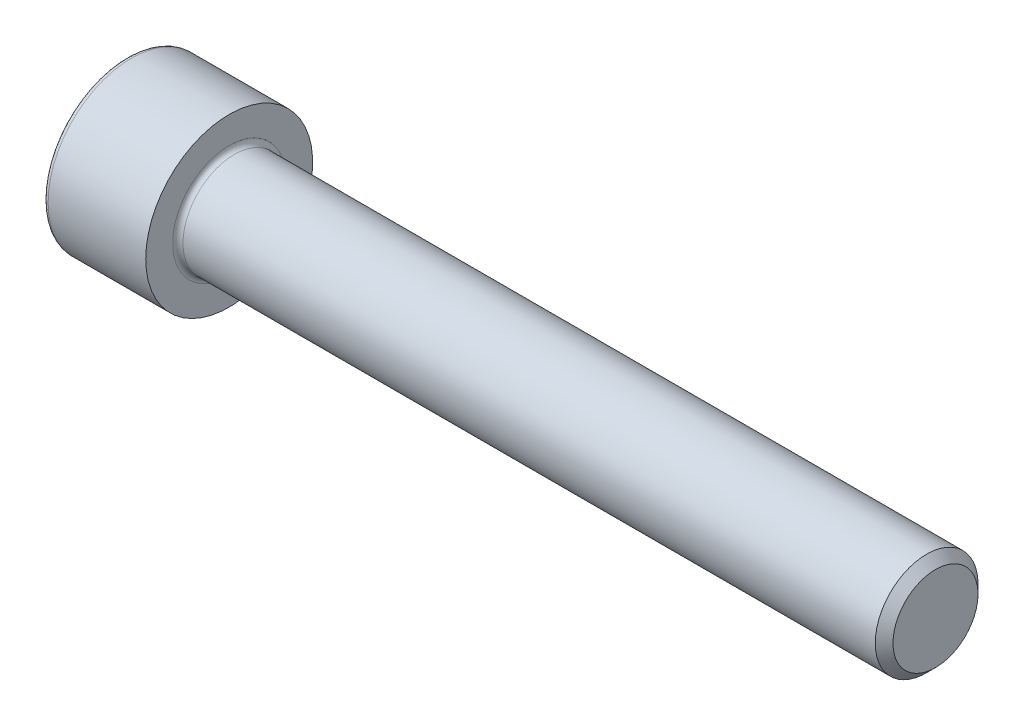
from build123d import *

# Parameters (mm, degrees)
FILLET1_R   = 0.4
FILLET2_R   = 0.4
HEX_2_DEPTH = 4


with BuildPart() as part:
    # BodySke → Base-Revolve (revolve)
    with BuildSketch(Plane.XY, mode=Mode.PRIVATE) as base_revolve_sk:
        Polygon((0, 0), (0, 6.5), (8, 6.5), (8, 4), (62.3095, 4), (63, 3.3095), (63, 0), align=None)
    revolve(base_revolve_sk.sketch.rotate(Axis((-31.75, 0, 0), (1, 0, 0)), 90), axis=Axis((-31.75, 0, 0), (1, 0, 0)))

    # Fillet1
    fillet1_edges = [part.edges().sort_by_distance(p)[0] for p in [
        (8, 0, -4),
    ]]
    fillet(fillet1_edges, radius=FILLET1_R)

    # Fillet2
    fillet2_edges = [part.edges().sort_by_distance(p)[0] for p in [
        (0, 0, -6.5),
    ]]
    fillet(fillet2_edges, radius=FILLET2_R)

    # Sketch2 → Hex-PreBroach (revolve, cut)
    with BuildSketch(Plane.XY, mode=Mode.PRIVATE) as hex_prebroach_sk:
        Polygon((0, 3.0475), (4, 3.0475), (5.759474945, 0), (0, 0), align=None)
    revolve(hex_prebroach_sk.sketch.rotate(Axis((0, 0, 0), (1, 0, 0)), 90), axis=Axis((0, 0, 0), (1, 0, 0)), mode=Mode.SUBTRACT)

    # Sketch3 → Hex 2 (cut)
    with BuildSketch(Plane(origin=(0, 0, 0), x_dir=(0, 0.500000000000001, 0.866025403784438), z_dir=(-1, 0, 0))):
        Polygon((1.759474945, 3.0475), (-1.759474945, 3.0475), (-3.518949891, 0), (-1.759474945, -3.0475), (1.759474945, -3.0475), (3.518949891, 0), align=None)
    extrude(amount=-HEX_2_DEPTH, mode=Mode.SUBTRACT)


solid = part.part
